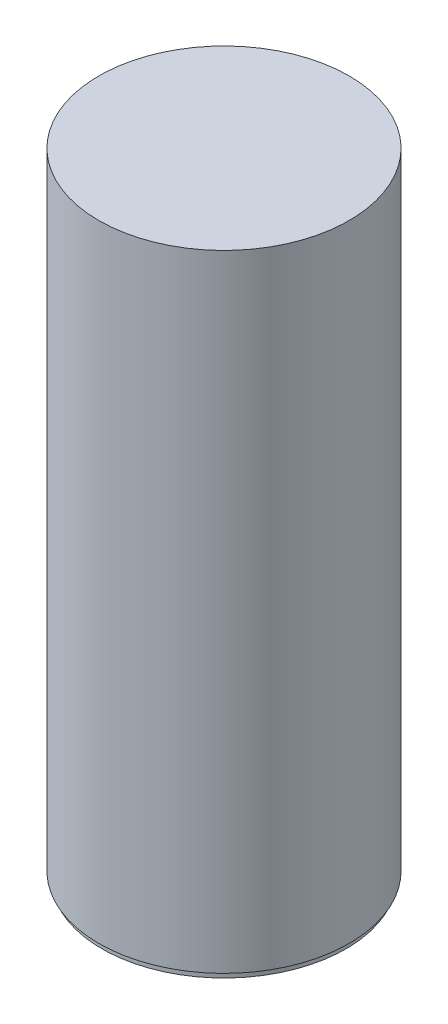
from build123d import *

# Parameters (mm, degrees)
CROQUIS1_R              = 20
SALIENTE_EXTRUIR1_DEPTH = 100
CROQUIS2_R              = 19.496962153
SALIENTE_EXTRUIR3_DEPTH = 1
CROQUIS3_R              = 17.559996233
CORTAR_EXTRUIR1_DEPTH   = 7
CORTAR_EXTRUIR1_DRAFT   = -22


with BuildPart() as part:
    # Croquis1 → Saliente-Extruir1 (new body)
    with BuildSketch(Plane(origin=(0, 0, 0), x_dir=(1, 0, 0), z_dir=(0, 1, 0))):
        with Locations(Location((0, 0, 0), (0, 0, 270))):
            Circle(CROQUIS1_R)
    extrude(amount=SALIENTE_EXTRUIR1_DEPTH)

    # Croquis2 → Saliente-Extruir3 (add)
    with BuildSketch(Plane.XZ):
        with Locations(Location((0, 0, 0), (0, 0, 270))):
            Circle(CROQUIS2_R)
    extrude(amount=SALIENTE_EXTRUIR3_DEPTH)


with BuildPart() as cortar_extruir1_tool:
    # Croquis3 → Cortar-Extruir1 (with draft: the straight prism first)
    with BuildSketch(Plane.XZ.offset(1)):
        Circle(CROQUIS3_R)
    extrude(amount=-CORTAR_EXTRUIR1_DEPTH)
    # Cortar-Extruir1: the draft: its side faces are tilted about the plane it starts from
    cortar_extruir1_sides = [cortar_extruir1_tool.faces().sort_by_distance(p)[0] for p in [
        (-17.559996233, 2.5, 0),
    ]]
    draft(cortar_extruir1_sides, Plane.XZ.offset(1), CORTAR_EXTRUIR1_DRAFT)


with BuildPart() as part_1:
    add(part.part)

    # Cortar-Extruir1: cut by cortar_extruir1_tool
    add(cortar_extruir1_tool.part, mode=Mode.SUBTRACT)


solid = part_1.part
